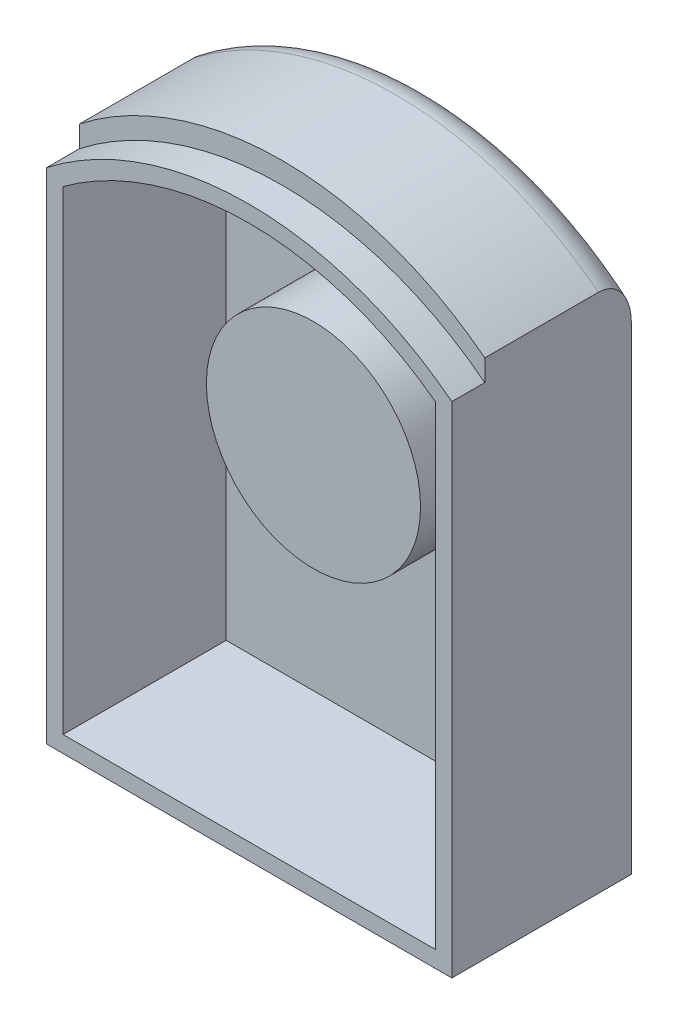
from build123d import *

# Parameters (mm, degrees)
BOSS_EXTRUDE1_DEPTH = 10
SHELL1_T            = -1
BOSS_EXTRUDE6_DEPTH = 8
BOSS_EXTRUDE7_START = 0.9
BOSS_EXTRUDE7_DEPTH = 0.9
CUT_EXTRUDE1_START  = -0.9
CUT_EXTRUDE1_DEPTH  = 0.9
FILLET1_R           = 2
SKETCH9_R           = 6.5
BOSS_EXTRUDE8_DEPTH = 7
SKETCH10_R          = 5.55
CUT_EXTRUDE2_DEPTH  = 4.2


with BuildPart() as part:
    # Sketch1 → Boss-Extrude1 (new body)
    with BuildSketch(Plane.XY):
        with BuildLine():
            Line((-12.3, 30.3), (-12.3, 0))
            Line((-12.3, 0), (12.3, 0))
            Line((12.3, 0), (12.3, 30.3))
            ThreePointArc((12.3, 30.3), (0, 34.529457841), (-12.3, 30.3))
        make_face()
    extrude(amount=BOSS_EXTRUDE1_DEPTH)

    # Shell1
    shell1_openings = [part.faces().sort_by_distance(p)[0] for p in [
        (0, 16.615699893, 10),
    ]]
    offset(amount=SHELL1_T, openings=shell1_openings, kind=Kind.INTERSECTION)

    # Sketch6 → Boss-Extrude6 (add)
    with BuildSketch(Plane(origin=(0, 0, 0), x_dir=(-1, 0, 0), z_dir=(0, 0, -1))):
        with BuildLine():
            Line((-12.3, 30.3), (-12.3, 31.6))
            ThreePointArc((-12.3, 31.6), (0, 35.829457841), (12.3, 31.6))
            Line((12.3, 31.6), (12.3, 30.3))
            ThreePointArc((12.3, 30.3), (0, 34.529457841), (-12.3, 30.3))
        make_face()
    extrude(amount=-BOSS_EXTRUDE6_DEPTH)

    # Sketch7 → Boss-Extrude7 (add)
    with BuildSketch(Plane(origin=(0, 0, 0), x_dir=(-1, 0, 0), z_dir=(0, 0, -1)).offset(BOSS_EXTRUDE7_START)):
        with BuildLine():
            Line((12.3, 0), (12.3, 31.6))
            ThreePointArc((12.3, 31.6), (0, 35.829457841), (-12.3, 31.6))
            Line((-12.3, 31.6), (-12.3, 0))
            Line((-12.3, 0), (12.3, 0))
        make_face()
    extrude(amount=-BOSS_EXTRUDE7_DEPTH)

    # Sketch8 → Cut-Extrude1 (cut)
    with BuildSketch(Plane.XY.offset(1).offset(CUT_EXTRUDE1_START)):
        with BuildLine():
            Line((-11.3, 29.803946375), (-11.3, 1))
            Line((-11.3, 1), (11.3, 1))
            Line((11.3, 1), (11.3, 29.803946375))
            ThreePointArc((11.3, 29.803946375), (0, 33.529457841), (-11.3, 29.803946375))
        make_face()
    extrude(amount=CUT_EXTRUDE1_DEPTH, mode=Mode.SUBTRACT)

    # Fillet1
    fillet1_edges = [part.edges().sort_by_distance(p)[0] for p in [
        (0, 35.829457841, -0.9),
    ]]
    fillet(fillet1_edges, radius=FILLET1_R)

    # Sketch9 → Boss-Extrude8 (add)
    with BuildSketch(Plane(origin=(0, 0, -0.9), x_dir=(-1, 0, 0), z_dir=(0, 0, -1))):
        with Locations((0, 19.91472892)):
            Circle(SKETCH9_R)
    extrude(amount=-BOSS_EXTRUDE8_DEPTH)

    # Sketch10 → Cut-Extrude2 (cut)
    with BuildSketch(Plane(origin=(0, 0, -0.9), x_dir=(-1, 0, 0), z_dir=(0, 0, -1))):
        with Locations((0, 19.91472892)):
            Circle(SKETCH10_R)
    extrude(amount=-CUT_EXTRUDE2_DEPTH, mode=Mode.SUBTRACT)


solid = part.part
